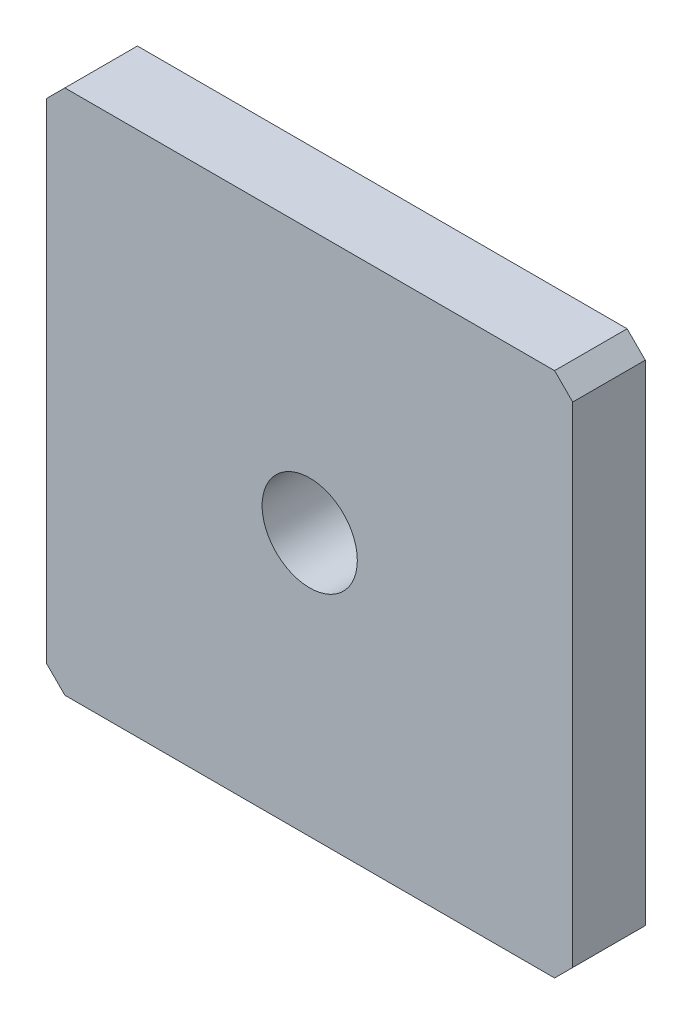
from build123d import *

# Parameters (mm, degrees)
ESQUISSE1_W                       = 58
ESQUISSE1_H                       = 58
EXTRUSION1_DEPTH                  = 8
DIAM_TRE_DU_PER_AGE_10_5_10_5_1_D = 10.5
CHANFREIN1_SIZE                   = 2


with BuildPart() as part:
    # Esquisse1 → Extrusion1 (new body)
    with BuildSketch(Plane.XY):
        with Locations((29, 29)):
            Rectangle(ESQUISSE1_W, ESQUISSE1_H)
    extrude(amount=EXTRUSION1_DEPTH)

    # Diam_tre du per_age _10.5 _10.5_1 (through all)
    with Locations(Plane(origin=(29, 29, 8), x_dir=(1, 0, 0), z_dir=(0, 0, 1))):
        with Locations((0, 0)):
            Hole(DIAM_TRE_DU_PER_AGE_10_5_10_5_1_D / 2)

    # Chanfrein1
    chanfrein1_edges = [part.edges().sort_by_distance(p)[0] for p in [
        (0, 58, 4),
        (58, 58, 4),
        (58, 0, 4),
        (0, 0, 4),
    ]]
    chamfer(chanfrein1_edges, length=CHANFREIN1_SIZE)


solid = part.part
